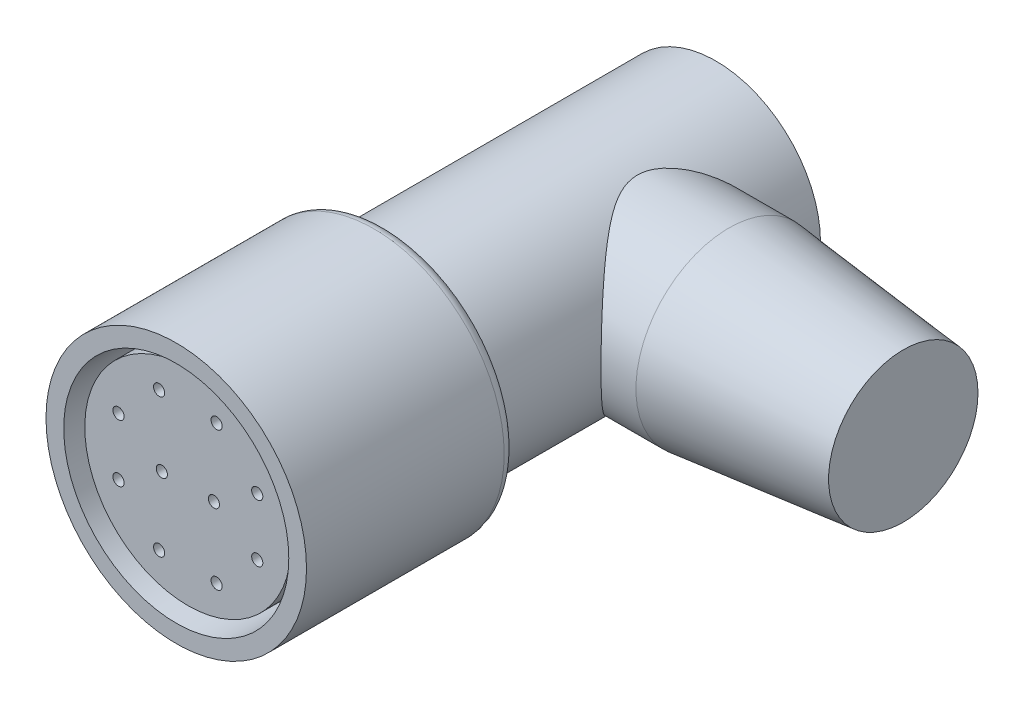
from build123d import *

# Parameters (mm, degrees)
SKETCH1_R           = 8.89
SKETCH1_R_2         = 7.681145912
BOSS_EXTRUDE1_DEPTH = 12.7
SKETCH2_R           = 8.89
SKETCH2_R_2         = 6.784824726
BOSS_EXTRUDE2_DEPTH = 1.5875
BOSS_EXTRUDE3_START = -0.79375
BOSS_EXTRUDE3_DEPTH = 11.90625
SKETCH4_R           = 0.381
CUT_EXTRUDE1_DEPTH  = 10.31875
CIRPATTERN1_COUNT   = 8
SKETCH5_R           = 0.381
CUT_EXTRUDE2_DEPTH  = 10.31875
SKETCH6_R           = 6.149824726
BOSS_EXTRUDE4_DEPTH = 2.38125
SKETCH7_R           = 7.14375
BOSS_EXTRUDE5_DEPTH = 21.74875
SKETCH8_R           = 6.35
BOSS_EXTRUDE6_DEPTH = 9.525
SKETCH9_R           = 6.35
BOSS_EXTRUDE7_DEPTH = 11.8999
BOSS_EXTRUDE7_TAPER = 6
FILLET1_R           = 0.79375


with BuildPart() as part:
    # Sketch1 → Boss-Extrude1 (new body)
    with BuildSketch(Plane.XY):
        Circle(SKETCH1_R)
        Circle(SKETCH1_R_2, mode=Mode.SUBTRACT)
    extrude(amount=-BOSS_EXTRUDE1_DEPTH)

    # Sketch2 → Boss-Extrude2 (add)
    with BuildSketch(Plane(origin=(0, 0, -12.7), x_dir=(-1, 0, 0), z_dir=(0, 0, -1))):
        with Locations(Location((0, 0, 0), (0, 0, 180))):
            Circle(SKETCH2_R)
        Circle(SKETCH2_R_2, mode=Mode.SUBTRACT)
    extrude(amount=BOSS_EXTRUDE2_DEPTH)

    # Sketch3 → Boss-Extrude3 (add)
    with BuildSketch(Plane.XY.offset(BOSS_EXTRUDE3_START)):
        with BuildLine():
            Line((-0.3175, 7.436550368), (0.3175, 7.436550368))
            Line((0.3175, 7.436550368), (0.3175, 7.02970354))
            ThreePointArc((0.3175, 7.02970354), (0, -7.036869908), (-0.3175, 7.02970354))
            Line((-0.3175, 7.02970354), (-0.3175, 7.436550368))
        make_face()
    extrude(amount=-BOSS_EXTRUDE3_DEPTH)

    # Sketch4 → Cut-Extrude1 (cut)
    with BuildSketch(Plane.XY.offset(-0.79375)):
        with Locations((4.734843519, 1.961236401)):
            Circle(SKETCH4_R)
    cut_extrude1 = extrude(amount=-CUT_EXTRUDE1_DEPTH, mode=Mode.SUBTRACT)

    # CirPattern1: Cut-Extrude1 ×8 about axis
    cirpattern1_axis = Axis((0, 0, 0), (0, 0, 1))
    for i in range(1, CIRPATTERN1_COUNT):
        add(cut_extrude1.rotate(cirpattern1_axis, i * 360 / CIRPATTERN1_COUNT), mode=Mode.SUBTRACT)

    # Sketch5 → Cut-Extrude2 (cut)
    with BuildSketch(Plane.XY.offset(-0.79375)):
        with Locations((-1.778, 0)):
            Circle(SKETCH5_R)
        with Locations((1.778, 0)):
            Circle(SKETCH5_R)
    extrude(amount=-CUT_EXTRUDE2_DEPTH, mode=Mode.SUBTRACT)

    # Sketch6 → Boss-Extrude4 (add)
    with BuildSketch(Plane(origin=(0, 0, -12.7), x_dir=(-1, 0, 0), z_dir=(0, 0, -1))):
        with Locations(Location((0, 0, 0), (0, 0, 180))):
            Circle(SKETCH6_R)
    extrude(amount=BOSS_EXTRUDE4_DEPTH)

    # Sketch7 → Boss-Extrude5 (add)
    with BuildSketch(Plane(origin=(0, 0, -15.08125), x_dir=(-1, 0, 0), z_dir=(0, 0, -1))):
        with Locations(Location((0, 0, 0), (0, 0, 180))):
            Circle(SKETCH7_R)
    extrude(amount=BOSS_EXTRUDE5_DEPTH)

    # Sketch8 → Boss-Extrude6 (add)
    with BuildSketch(Plane(origin=(0, 0, 0), x_dir=(0, 0, -1), z_dir=(1, 0, 0))):
        with Locations((28.19863485, 0)):
            Circle(SKETCH8_R)
    extrude(amount=BOSS_EXTRUDE6_DEPTH)

    # Sketch9 → Boss-Extrude7 (add)
    with BuildSketch(Plane(origin=(9.525, 0, 0), x_dir=(0, 0, -1), z_dir=(1, 0, 0))):
        with Locations((28.19863485, 0)):
            Circle(SKETCH9_R)
    extrude(amount=BOSS_EXTRUDE7_DEPTH, taper=BOSS_EXTRUDE7_TAPER)

    # Fillet1
    fillet1_edges = [part.edges().sort_by_distance(p)[0] for p in [
        (-8.89, 0, -14.2875),
    ]]
    fillet(fillet1_edges, radius=FILLET1_R)


solid = part.part
